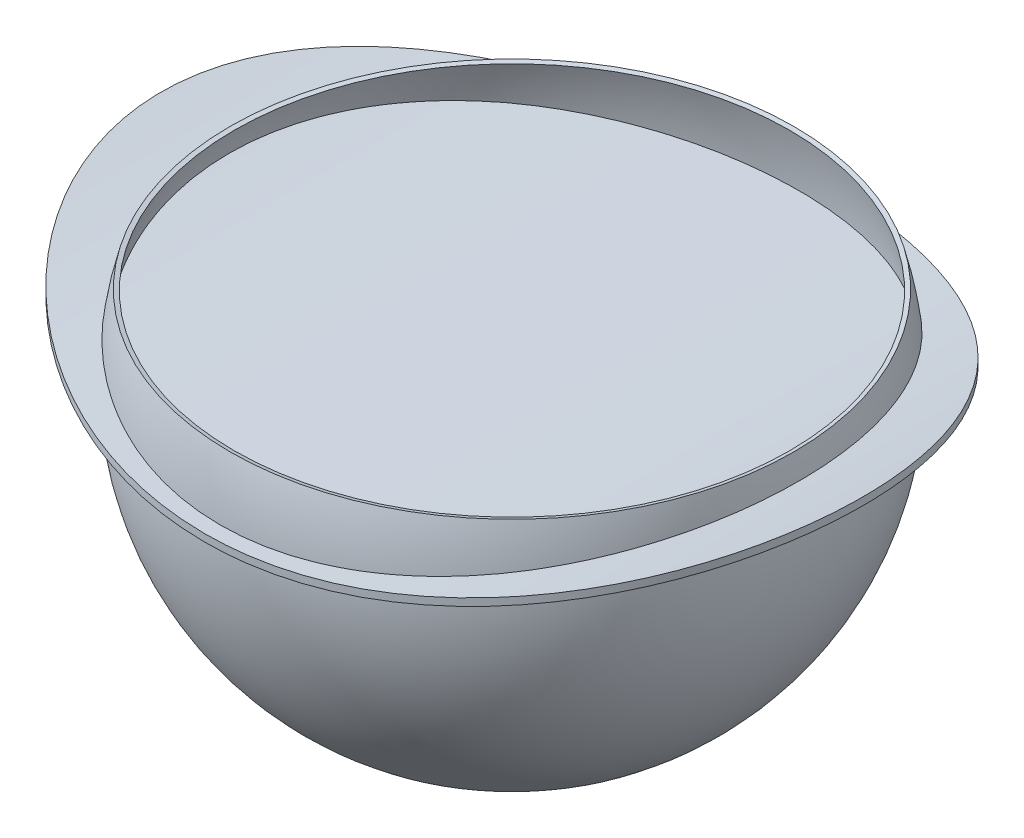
from build123d import *

# Parameters (mm, degrees)
EXTRUDE_THIN1_DEPTH = 105
SKETCH3_OUTSIDE_W   = 311.182
SKETCH3_OUTSIDE_H   = 279.682
SKETCH3_OUTSIDE_RX  = 120
SKETCH3_OUTSIDE_RY  = 105
CUT_EXTRUDE1_DEPTH  = 195.179202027


with BuildPart() as part:
    # Sketch1 → Revolve-Thin1 (revolve)
    with BuildSketch(Plane(origin=(0, 0, 0), x_dir=(0, 0, -1), z_dir=(1, 0, 0))):
        with BuildLine():
            Line((0, 0), (55, 0))
            ThreePointArc((55, 0), (93.58265401, 48.270375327), (96.429364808, 110))
            Line((96.429364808, 110), (94.982924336, 109.602746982))
            ThreePointArc((94.982924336, 109.602746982), (92.257627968, 49.008783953), (54.548596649, 1.5))
            Line((54.548596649, 1.5), (0, 1.5))
            Line((0, 1.5), (0, 0))
        make_face()
    revolve(axis=Axis((0, 0, 0), (0, 1, 0)))


with BuildPart() as body_2:
    # Sketch2 → Extrude-Thin1 (new, symmetric)
    with BuildSketch(Plane.XY):
        with BuildLine():
            ThreePointArc((-120, 108.424319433), (0, 90), (120, 108.424319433))
            Line((120, 108.424319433), (120.75, 106.03947143))
            ThreePointArc((120.75, 106.03947143), (0, 87.5), (-120.75, 106.03947143))
            Line((-120.75, 106.03947143), (-120, 108.424319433))
        make_face()
    extrude(amount=EXTRUDE_THIN1_DEPTH, both=True)

    # Sketch3 outside → Cut-Extrude1 (cut, through all)
    with BuildSketch(Plane(origin=(0, 0, 0), x_dir=(1, 0, 0), z_dir=(0, 1, 0))):
        Rectangle(SKETCH3_OUTSIDE_W, SKETCH3_OUTSIDE_H)
        with Locations(Location((0, 0), (0, 0, 180))):
            Ellipse(SKETCH3_OUTSIDE_RX, SKETCH3_OUTSIDE_RY, mode=Mode.SUBTRACT)
    extrude(amount=CUT_EXTRUDE1_DEPTH, mode=Mode.SUBTRACT)


solid = Compound([part.part, body_2.part])
